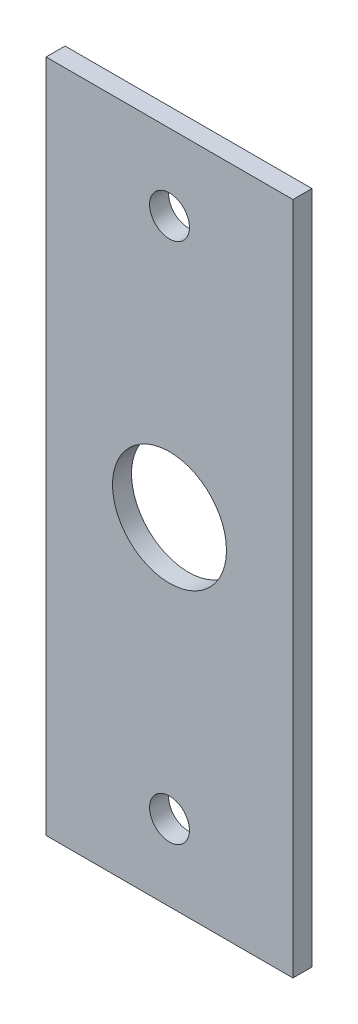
from build123d import *

# Parameters (mm, degrees)
SKETCH_1_W          = 30
SKETCH_1_H          = 71
EXTRUDE_1_DEPTH     = 2
SKETCH_2_R          = 6
CUT_EXTRUDE_1_DEPTH = 2
HOLE_WIZARD_M5_1_D  = 4.2
SKETCH_5_W          = 2
SKETCH_5_H          = 71
CUT_EXTRUDE_2_DEPTH = 2
SKETCH_7_W          = 2
SKETCH_7_H          = 71
CUT_EXTRUDE_3_DEPTH = 2


with BuildPart() as part:
    # Sketch 1 → Extrude 1 (new body)
    with BuildSketch(Plane.XY):
        Rectangle(SKETCH_1_W, SKETCH_1_H)
    extrude(amount=EXTRUDE_1_DEPTH)

    # Sketch 2 → Cut-Extrude 1 (cut)
    with BuildSketch(Plane.XY.offset(2)):
        Circle(SKETCH_2_R)
    extrude(amount=-CUT_EXTRUDE_1_DEPTH, mode=Mode.SUBTRACT)

    # Hole Wizard M5 _1 (through all)
    with Locations(Plane.XY.offset(2)):
        with Locations((0, 27.5), (0, -27.5)):
            Hole(HOLE_WIZARD_M5_1_D / 2)

    # Sketch 5 → Cut-Extrude 2 (cut)
    with BuildSketch(Plane(origin=(15, 0, 0), x_dir=(0, 0, -1), z_dir=(1, 0, 0))):
        with Locations((-1, 0)):
            Rectangle(SKETCH_5_W, SKETCH_5_H)
    extrude(amount=-CUT_EXTRUDE_2_DEPTH, mode=Mode.SUBTRACT)

    # Sketch 7 → Cut-Extrude 3 (cut)
    with BuildSketch(Plane.ZY.offset(15)):
        with Locations((1, 0)):
            Rectangle(SKETCH_7_W, SKETCH_7_H)
    extrude(amount=-CUT_EXTRUDE_3_DEPTH, mode=Mode.SUBTRACT)


solid = part.part
